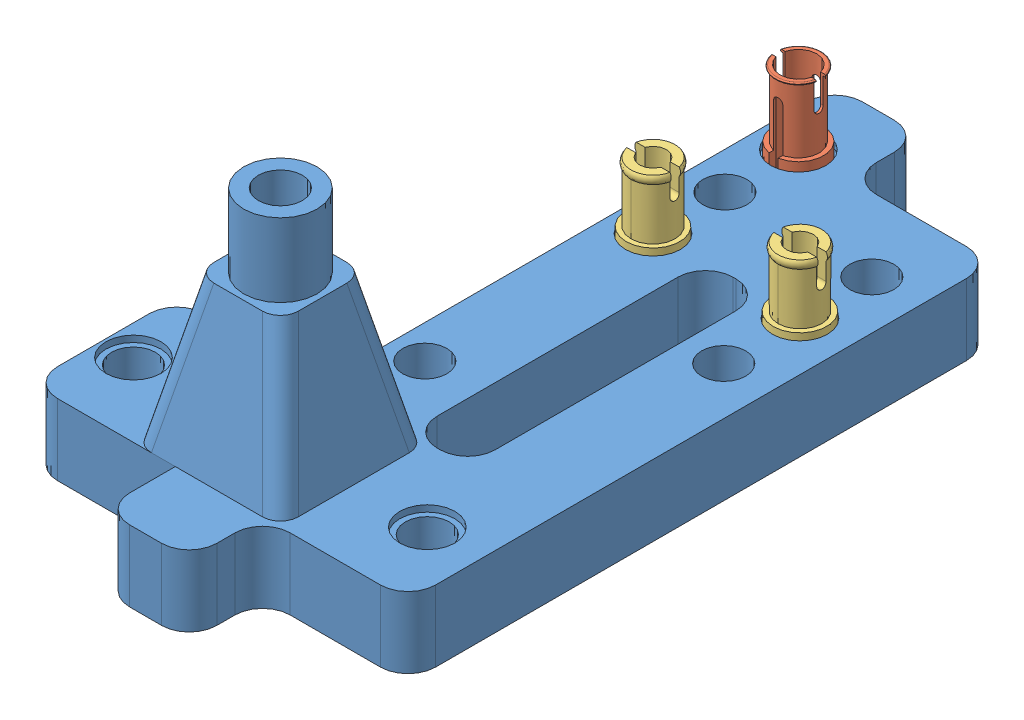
SolidWorks assembly Assem2.sldasm, configuration Default (file format 4400). Lengths in mm.
Overall size (41.18 31.96 79.8).
4 component instances, 3 part files, 6 mates.
Components (placement in the parent):
- Part Side frame Left-1: Part Side frame Left.SLDPRT [Default] at origin size (41.18 31.75 79.8)
- Open Pin Zwart-1: Open Pin Zwart.SLDPRT [Défaut] at (19.882 -0.2 -66.31) x (0 1 0) z (0 0 1) size (16.01 5.5 5.41)
- Pin Glashelder-1: Pin Glashelder.sldprt [Default] at (35.882 7.05 -47.98) x (0 -1 0) z (0 0 1) size (14.4 5.84 5.84)
- Pin Glashelder-2: Pin Glashelder.sldprt [Default] at (19.882 8.45 -47.98) x (0 1 0) z (0 0 1) size (14.4 5.84 5.84)
Mates (geometry in assembly coordinates):
- Concentric1: concentric: cylinder of Part Side frame Left-1 through (35.882 0 -47.98) axis (0 1 0) radius 2.4; cylinder of Pin Glashelder-1 through (35.882 0.55 -47.98) axis (0 1 0) radius 2.4
- Concentric2: concentric: cylinder of Part Side frame Left-1 through (19.882 0 -47.98) axis (0 1 0) radius 2.4; cylinder of Pin Glashelder-2 through (19.882 0.55 -47.98) axis (0 1 0) radius 2.3876
- Concentric3: concentric: cylinder of Part Side frame Left-1 through (19.882 0 -63.81) axis (0 1 0) radius 2.4; cylinder of Open Pin Zwart-1 through (19.882 -0.8463 -63.81) axis (0 -1 0) radius 2.25
- Coincident1: coincident anti-aligned: plane of Part Side frame Left-1 through (19.882 7.05 -63.81) normal (0 1 0); plane of Open Pin Zwart-1 through (19.882 7.05 -66.06) normal (0 -1 0)
- Coincident2: coincident anti-aligned: plane of Part Side frame Left-1 through (35.882 7.05 -47.98) normal (0 1 0); plane of Pin Glashelder-1 through (35.882 7.05 -47.98) normal (0 -1 0)
- Coincident3: coincident aligned: circle of Part Side frame Left-1; plane of Pin Glashelder-2 through (19.882 7.05 -47.98) normal (0 -1 0)
